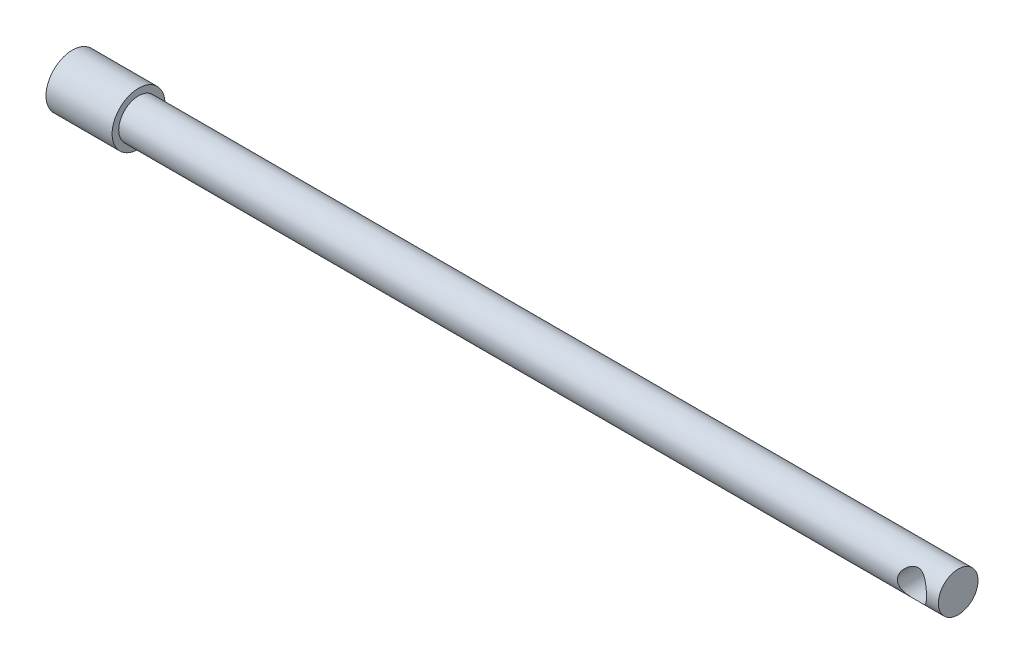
ISO-10303-21;
HEADER;
FILE_DESCRIPTION(('STEP AP214'),'2;1');
FILE_NAME('part.step','',(''),(''),'','','');
FILE_SCHEMA(('AUTOMOTIVE_DESIGN { 1 0 10303 214 1 1 1 1 }'));
ENDSEC;
DATA;
#1=APPLICATION_CONTEXT('core data for automotive mechanical design processes');
#2=APPLICATION_PROTOCOL_DEFINITION('international standard','automotive_design',2000,#1);
#3=PRODUCT_CONTEXT('',#1,'mechanical');
#4=PRODUCT('Part','Part','',(#3));
#5=PRODUCT_RELATED_PRODUCT_CATEGORY('part','',(#4));
#6=PRODUCT_DEFINITION_FORMATION('','',#4);
#7=PRODUCT_DEFINITION_CONTEXT('part definition',#1,'design');
#8=PRODUCT_DEFINITION('design','',#6,#7);
#9=PRODUCT_DEFINITION_SHAPE('','',#8);
#10=(LENGTH_UNIT() NAMED_UNIT(*) SI_UNIT(.MILLI.,.METRE.));
#11=(NAMED_UNIT(*) PLANE_ANGLE_UNIT() SI_UNIT($,.RADIAN.));
#12=(NAMED_UNIT(*) SI_UNIT($,.STERADIAN.) SOLID_ANGLE_UNIT());
#13=UNCERTAINTY_MEASURE_WITH_UNIT(LENGTH_MEASURE(1.E-05),#10,'distance_accuracy_value','');
#14=(GEOMETRIC_REPRESENTATION_CONTEXT(3) GLOBAL_UNCERTAINTY_ASSIGNED_CONTEXT((#13)) GLOBAL_UNIT_ASSIGNED_CONTEXT((#10,
#11,#12)) REPRESENTATION_CONTEXT('',''));
#15=CARTESIAN_POINT('',(0.,0.,0.));
#16=DIRECTION('',(0.,0.,1.));
#17=DIRECTION('',(1.,0.,0.));
#18=AXIS2_PLACEMENT_3D('',#15,#16,#17);
#19=CARTESIAN_POINT('',(-650.,0.,0.));
#20=DIRECTION('',(1.,0.,0.));
#21=DIRECTION('',(0.,0.,-1.));
#22=AXIS2_PLACEMENT_3D('',#19,#20,#21);
#23=PLANE('',#22);
#24=CARTESIAN_POINT('',(-650.,0.,0.));
#25=DIRECTION('',(-1.,0.,0.));
#26=DIRECTION('',(0.,0.,1.));
#27=AXIS2_PLACEMENT_3D('',#24,#25,#26);
#28=CIRCLE('',#27,20.);
#29=CARTESIAN_POINT('',(-650.,0.,20.));
#30=VERTEX_POINT('',#29);
#31=EDGE_CURVE('E18',#30,#30,#28,.F.);
#32=ORIENTED_EDGE('',*,*,#31,.F.);
#33=EDGE_LOOP('',(#32));
#34=FACE_BOUND('',#33,.T.);
#35=ADVANCED_FACE('F13',(#34),#23,.F.);
#36=CARTESIAN_POINT('',(-600.,0.,0.));
#37=DIRECTION('',(-1.,0.,0.));
#38=DIRECTION('',(0.,0.,1.));
#39=AXIS2_PLACEMENT_3D('',#36,#37,#38);
#40=CYLINDRICAL_SURFACE('',#39,20.);
#41=ORIENTED_EDGE('',*,*,#31,.T.);
#42=EDGE_LOOP('',(#41));
#43=FACE_BOUND('',#42,.T.);
#44=CARTESIAN_POINT('',(-600.,0.,0.));
#45=DIRECTION('',(-1.,0.,0.));
#46=DIRECTION('',(0.,0.,1.));
#47=AXIS2_PLACEMENT_3D('',#44,#45,#46);
#48=CIRCLE('',#47,20.);
#49=CARTESIAN_POINT('',(-600.,0.,20.));
#50=VERTEX_POINT('',#49);
#51=EDGE_CURVE('E46',#50,#50,#48,.T.);
#52=ORIENTED_EDGE('',*,*,#51,.T.);
#53=EDGE_LOOP('',(#52));
#54=FACE_BOUND('',#53,.T.);
#55=ADVANCED_FACE('F53',(#43,#54),#40,.T.);
#56=CARTESIAN_POINT('',(20.,0.,0.));
#57=DIRECTION('',(1.,0.,0.));
#58=DIRECTION('',(0.,0.,-1.));
#59=AXIS2_PLACEMENT_3D('',#56,#57,#58);
#60=PLANE('',#59);
#61=CARTESIAN_POINT('',(20.,0.,0.));
#62=DIRECTION('',(-1.,0.,0.));
#63=DIRECTION('',(0.,0.,1.));
#64=AXIS2_PLACEMENT_3D('',#61,#62,#63);
#65=CIRCLE('',#64,15.);
#66=CARTESIAN_POINT('',(20.,0.,15.));
#67=VERTEX_POINT('',#66);
#68=EDGE_CURVE('E44',#67,#67,#65,.T.);
#69=ORIENTED_EDGE('',*,*,#68,.F.);
#70=EDGE_LOOP('',(#69));
#71=FACE_BOUND('',#70,.T.);
#72=ADVANCED_FACE('F61',(#71),#60,.T.);
#73=CARTESIAN_POINT('',(-600.,0.,0.));
#74=DIRECTION('',(-1.,0.,0.));
#75=DIRECTION('',(0.,0.,1.));
#76=AXIS2_PLACEMENT_3D('',#73,#74,#75);
#77=PLANE('',#76);
#78=CARTESIAN_POINT('',(-600.,0.,0.));
#79=DIRECTION('',(-1.,0.,0.));
#80=DIRECTION('',(0.,0.,1.));
#81=AXIS2_PLACEMENT_3D('',#78,#79,#80);
#82=CIRCLE('',#81,15.);
#83=CARTESIAN_POINT('',(-600.,0.,15.));
#84=VERTEX_POINT('',#83);
#85=EDGE_CURVE('E22',#84,#84,#82,.F.);
#86=ORIENTED_EDGE('',*,*,#85,.F.);
#87=EDGE_LOOP('',(#86));
#88=FACE_BOUND('',#87,.T.);
#89=ORIENTED_EDGE('',*,*,#51,.F.);
#90=EDGE_LOOP('',(#89));
#91=FACE_BOUND('',#90,.T.);
#92=ADVANCED_FACE('F36',(#88,#91),#77,.F.);
#93=CARTESIAN_POINT('',(0.,0.,-15.));
#94=DIRECTION('',(0.,0.,1.));
#95=DIRECTION('',(1.,0.,0.));
#96=AXIS2_PLACEMENT_3D('',#93,#94,#95);
#97=CYLINDRICAL_SURFACE('',#96,11.);
#98=CARTESIAN_POINT('',(11.,0.,-15.));
#99=CARTESIAN_POINT('',(10.9999989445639,0.270234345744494,-14.9999989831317));
#100=CARTESIAN_POINT('',(10.9900265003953,0.540485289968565,-14.9926814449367));
#101=CARTESIAN_POINT('',(10.950295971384,1.07885095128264,-14.963582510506));
#102=CARTESIAN_POINT('',(10.9205289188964,1.34696464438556,-14.9417945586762));
#103=CARTESIAN_POINT('',(10.8416275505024,1.87926318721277,-14.8842251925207));
#104=CARTESIAN_POINT('',(10.792460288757,2.14344055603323,-14.8484199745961));
#105=CARTESIAN_POINT('',(10.6755308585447,2.66544248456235,-14.7636492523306));
#106=CARTESIAN_POINT('',(10.60777051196,2.92326766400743,-14.7146850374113));
#107=CARTESIAN_POINT('',(10.455056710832,3.42947281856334,-14.6049788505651));
#108=CARTESIAN_POINT('',(10.3702054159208,3.67789896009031,-14.5443069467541));
#109=CARTESIAN_POINT('',(10.1841148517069,4.16556445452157,-14.4122135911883));
#110=CARTESIAN_POINT('',(10.0828752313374,4.40480361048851,-14.3407919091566));
#111=CARTESIAN_POINT('',(9.86513916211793,4.87295052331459,-14.1885487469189));
#112=CARTESIAN_POINT('',(9.7486501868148,5.10186326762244,-14.1077318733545));
#113=CARTESIAN_POINT('',(9.50137535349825,5.5487947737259,-13.9380072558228));
#114=CARTESIAN_POINT('',(9.37058417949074,5.76680944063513,-13.8490965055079));
#115=CARTESIAN_POINT('',(9.08316785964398,6.21065135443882,-13.6561916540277));
#116=CARTESIAN_POINT('',(8.92527466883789,6.4353804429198,-13.5515613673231));
#117=CARTESIAN_POINT('',(8.59474679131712,6.8705899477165,-13.3361895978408));
#118=CARTESIAN_POINT('',(8.42211168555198,7.08106995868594,-13.2254479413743));
#119=CARTESIAN_POINT('',(8.06272673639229,7.48773584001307,-12.9995381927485));
#120=CARTESIAN_POINT('',(7.87595550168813,7.68389912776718,-12.8843635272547));
#121=CARTESIAN_POINT('',(7.48928883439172,8.06123556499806,-12.6517037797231));
#122=CARTESIAN_POINT('',(7.28939585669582,8.242411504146,-12.5342191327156));
#123=CARTESIAN_POINT('',(6.83682363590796,8.62331346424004,-12.2760403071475));
#124=CARTESIAN_POINT('',(6.58144005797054,8.81979231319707,-12.1352768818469));
#125=CARTESIAN_POINT('',(6.05311944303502,9.19042440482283,-11.8570571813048));
#126=CARTESIAN_POINT('',(5.7801773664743,9.36457119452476,-11.7196018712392));
#127=CARTESIAN_POINT('',(5.21744212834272,9.68936187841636,-11.4525286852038));
#128=CARTESIAN_POINT('',(4.92766801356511,9.84003165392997,-11.3229022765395));
#129=CARTESIAN_POINT('',(4.33141573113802,10.1166556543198,-11.076442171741));
#130=CARTESIAN_POINT('',(4.02494703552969,10.242623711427,-10.9596013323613));
#131=CARTESIAN_POINT('',(3.50094853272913,10.4303850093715,-10.7804394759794));
#132=CARTESIAN_POINT('',(3.28782250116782,10.4995737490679,-10.7129270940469));
#133=CARTESIAN_POINT('',(2.85500800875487,10.625426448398,-10.5881143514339));
#134=CARTESIAN_POINT('',(2.6353216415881,10.6820943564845,-10.5308107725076));
#135=CARTESIAN_POINT('',(2.19056026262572,10.7820819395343,-10.4284147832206));
#136=CARTESIAN_POINT('',(1.9654960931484,10.8254263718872,-10.3832997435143));
#137=CARTESIAN_POINT('',(1.51077883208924,10.8981901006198,-10.3069029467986));
#138=CARTESIAN_POINT('',(1.28112576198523,10.9276094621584,-10.2756211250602));
#139=CARTESIAN_POINT('',(0.817016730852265,10.9721120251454,-10.2280907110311));
#140=CARTESIAN_POINT('',(0.582537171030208,10.9870802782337,-10.2119626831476));
#141=CARTESIAN_POINT('',(0.112548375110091,11.0019364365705,-10.1959559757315));
#142=CARTESIAN_POINT('',(-0.122960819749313,11.0018249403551,-10.1960766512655));
#143=CARTESIAN_POINT('',(-0.593049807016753,10.9865203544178,-10.2125654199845));
#144=CARTESIAN_POINT('',(-0.827628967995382,10.9713183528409,-10.2289431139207));
#145=CARTESIAN_POINT('',(-1.29374843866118,10.9261645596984,-10.2771594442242));
#146=CARTESIAN_POINT('',(-1.52528840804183,10.8962111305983,-10.3089997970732));
#147=CARTESIAN_POINT('',(-2.00856310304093,10.8181280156,-10.3909399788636));
#148=CARTESIAN_POINT('',(-2.25976351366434,10.7683789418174,-10.4426460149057));
#149=CARTESIAN_POINT('',(-2.75472374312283,10.6525201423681,-10.5608080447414));
#150=CARTESIAN_POINT('',(-2.99848250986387,10.5864081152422,-10.6272661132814));
#151=CARTESIAN_POINT('',(-3.71799960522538,10.3647718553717,-10.8450088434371));
#152=CARTESIAN_POINT('',(-4.18133061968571,10.1860595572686,-11.0145361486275));
#153=CARTESIAN_POINT('',(-4.92554456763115,9.84116811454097,-11.3219366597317));
#154=CARTESIAN_POINT('',(-5.2168211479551,9.68975954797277,-11.4522158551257));
#155=CARTESIAN_POINT('',(-5.78225957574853,9.36333004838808,-11.7206082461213));
#156=CARTESIAN_POINT('',(-6.05641582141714,9.18830144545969,-11.8587239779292));
#157=CARTESIAN_POINT('',(-6.58728128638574,8.81550158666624,-12.1384232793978));
#158=CARTESIAN_POINT('',(-6.8439744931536,8.61770989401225,-12.2800098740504));
#159=CARTESIAN_POINT('',(-7.33908375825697,8.20016329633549,-12.562678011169));
#160=CARTESIAN_POINT('',(-7.57750193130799,7.9804109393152,-12.7037596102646));
#161=CARTESIAN_POINT('',(-8.03836541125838,7.51619216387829,-12.9838893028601));
#162=CARTESIAN_POINT('',(-8.26054003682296,7.27142254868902,-13.1228811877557));
#163=CARTESIAN_POINT('',(-8.68379183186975,6.76031353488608,-13.3933474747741));
#164=CARTESIAN_POINT('',(-8.88486659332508,6.4939716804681,-13.5248210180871));
#165=CARTESIAN_POINT('',(-9.26374282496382,5.9409781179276,-13.7766812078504));
#166=CARTESIAN_POINT('',(-9.44158119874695,5.65435975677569,-13.8970853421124));
#167=CARTESIAN_POINT('',(-9.7721047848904,5.06171559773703,-14.1237235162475));
#168=CARTESIAN_POINT('',(-9.92480016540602,4.75569771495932,-14.2299632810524));
#169=CARTESIAN_POINT('',(-10.1671126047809,4.20659794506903,-14.4001660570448));
#170=CARTESIAN_POINT('',(-10.2628788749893,3.96740850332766,-14.4679959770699));
#171=CARTESIAN_POINT('',(-10.4380921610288,3.48039642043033,-14.5928058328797));
#172=CARTESIAN_POINT('',(-10.5175428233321,3.2325757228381,-14.649788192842));
#173=CARTESIAN_POINT('',(-10.659004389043,2.73012906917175,-14.7516769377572));
#174=CARTESIAN_POINT('',(-10.7210502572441,2.47551789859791,-14.7966075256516));
#175=CARTESIAN_POINT('',(-10.8270300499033,1.96072320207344,-14.8735755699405));
#176=CARTESIAN_POINT('',(-10.87097136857,1.70054199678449,-14.9056182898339));
#177=CARTESIAN_POINT('',(-10.9368839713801,1.20084572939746,-14.953761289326));
#178=CARTESIAN_POINT('',(-10.9605217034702,0.961665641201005,-14.9710694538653));
#179=CARTESIAN_POINT('',(-10.9920819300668,0.481661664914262,-14.994190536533));
#180=CARTESIAN_POINT('',(-11.0000009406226,0.240837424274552,-15.0000009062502));
#181=CARTESIAN_POINT('',(-10.9999989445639,-0.270234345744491,-14.9999989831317));
#182=CARTESIAN_POINT('',(-10.9900265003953,-0.540485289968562,-14.9926814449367));
#183=CARTESIAN_POINT('',(-10.950295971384,-1.07885095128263,-14.963582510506));
#184=CARTESIAN_POINT('',(-10.9205289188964,-1.34696464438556,-14.9417945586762));
#185=CARTESIAN_POINT('',(-10.8416275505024,-1.87926318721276,-14.8842251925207));
#186=CARTESIAN_POINT('',(-10.792460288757,-2.14344055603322,-14.8484199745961));
#187=CARTESIAN_POINT('',(-10.6755308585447,-2.66544248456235,-14.7636492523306));
#188=CARTESIAN_POINT('',(-10.60777051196,-2.92326766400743,-14.7146850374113));
#189=CARTESIAN_POINT('',(-10.455056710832,-3.42947281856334,-14.6049788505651));
#190=CARTESIAN_POINT('',(-10.3702054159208,-3.67789896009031,-14.5443069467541));
#191=CARTESIAN_POINT('',(-10.1841148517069,-4.16556445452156,-14.4122135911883));
#192=CARTESIAN_POINT('',(-10.0828752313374,-4.40480361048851,-14.3407919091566));
#193=CARTESIAN_POINT('',(-9.86513916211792,-4.87295052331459,-14.1885487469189));
#194=CARTESIAN_POINT('',(-9.7486501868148,-5.10186326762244,-14.1077318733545));
#195=CARTESIAN_POINT('',(-9.50137535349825,-5.5487947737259,-13.9380072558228));
#196=CARTESIAN_POINT('',(-9.37058417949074,-5.76680944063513,-13.8490965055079));
#197=CARTESIAN_POINT('',(-9.08316785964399,-6.21065135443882,-13.6561916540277));
#198=CARTESIAN_POINT('',(-8.92527466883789,-6.4353804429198,-13.5515613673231));
#199=CARTESIAN_POINT('',(-8.59474679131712,-6.8705899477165,-13.3361895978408));
#200=CARTESIAN_POINT('',(-8.42211168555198,-7.08106995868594,-13.2254479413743));
#201=CARTESIAN_POINT('',(-8.06272673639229,-7.48773584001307,-12.9995381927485));
#202=CARTESIAN_POINT('',(-7.87595550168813,-7.68389912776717,-12.8843635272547));
#203=CARTESIAN_POINT('',(-7.48928883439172,-8.06123556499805,-12.6517037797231));
#204=CARTESIAN_POINT('',(-7.28939585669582,-8.242411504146,-12.5342191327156));
#205=CARTESIAN_POINT('',(-6.83682363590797,-8.62331346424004,-12.2760403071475));
#206=CARTESIAN_POINT('',(-6.58144005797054,-8.81979231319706,-12.1352768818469));
#207=CARTESIAN_POINT('',(-6.05311944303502,-9.19042440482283,-11.8570571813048));
#208=CARTESIAN_POINT('',(-5.78017736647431,-9.36457119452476,-11.7196018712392));
#209=CARTESIAN_POINT('',(-5.21744212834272,-9.68936187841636,-11.4525286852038));
#210=CARTESIAN_POINT('',(-4.92766801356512,-9.84003165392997,-11.3229022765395));
#211=CARTESIAN_POINT('',(-4.33141573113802,-10.1166556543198,-11.076442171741));
#212=CARTESIAN_POINT('',(-4.02494703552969,-10.242623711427,-10.9596013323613));
#213=CARTESIAN_POINT('',(-3.50094853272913,-10.4303850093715,-10.7804394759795));
#214=CARTESIAN_POINT('',(-3.28782250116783,-10.4995737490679,-10.7129270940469));
#215=CARTESIAN_POINT('',(-2.85500800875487,-10.625426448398,-10.5881143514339));
#216=CARTESIAN_POINT('',(-2.63532164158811,-10.6820943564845,-10.5308107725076));
#217=CARTESIAN_POINT('',(-2.19056026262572,-10.7820819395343,-10.4284147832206));
#218=CARTESIAN_POINT('',(-1.9654960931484,-10.8254263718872,-10.3832997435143));
#219=CARTESIAN_POINT('',(-1.51077883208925,-10.8981901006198,-10.3069029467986));
#220=CARTESIAN_POINT('',(-1.28112576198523,-10.9276094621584,-10.2756211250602));
#221=CARTESIAN_POINT('',(-0.817016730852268,-10.9721120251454,-10.2280907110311));
#222=CARTESIAN_POINT('',(-0.582537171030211,-10.9870802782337,-10.2119626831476));
#223=CARTESIAN_POINT('',(-0.112548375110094,-11.0019364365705,-10.1959559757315));
#224=CARTESIAN_POINT('',(0.12296081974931,-11.0018249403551,-10.1960766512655));
#225=CARTESIAN_POINT('',(0.593049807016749,-10.9865203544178,-10.2125654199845));
#226=CARTESIAN_POINT('',(0.827628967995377,-10.9713183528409,-10.2289431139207));
#227=CARTESIAN_POINT('',(1.29374843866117,-10.9261645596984,-10.2771594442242));
#228=CARTESIAN_POINT('',(1.52528840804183,-10.8962111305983,-10.3089997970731));
#229=CARTESIAN_POINT('',(2.00856310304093,-10.8181280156,-10.3909399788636));
#230=CARTESIAN_POINT('',(2.25976351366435,-10.7683789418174,-10.4426460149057));
#231=CARTESIAN_POINT('',(2.75472374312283,-10.652520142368,-10.5608080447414));
#232=CARTESIAN_POINT('',(2.99848250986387,-10.5864081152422,-10.6272661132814));
#233=CARTESIAN_POINT('',(3.71799960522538,-10.3647718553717,-10.8450088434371));
#234=CARTESIAN_POINT('',(4.1813306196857,-10.1860595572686,-11.0145361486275));
#235=CARTESIAN_POINT('',(4.92554456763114,-9.84116811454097,-11.3219366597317));
#236=CARTESIAN_POINT('',(5.21682114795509,-9.68975954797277,-11.4522158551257));
#237=CARTESIAN_POINT('',(5.78225957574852,-9.36333004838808,-11.7206082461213));
#238=CARTESIAN_POINT('',(6.05641582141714,-9.1883014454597,-11.8587239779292));
#239=CARTESIAN_POINT('',(6.58728128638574,-8.81550158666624,-12.1384232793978));
#240=CARTESIAN_POINT('',(6.84397449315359,-8.61770989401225,-12.2800098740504));
#241=CARTESIAN_POINT('',(7.33908375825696,-8.20016329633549,-12.562678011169));
#242=CARTESIAN_POINT('',(7.57750193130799,-7.9804109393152,-12.7037596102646));
#243=CARTESIAN_POINT('',(8.03836541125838,-7.51619216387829,-12.9838893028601));
#244=CARTESIAN_POINT('',(8.26054003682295,-7.27142254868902,-13.1228811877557));
#245=CARTESIAN_POINT('',(8.68379183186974,-6.76031353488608,-13.3933474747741));
#246=CARTESIAN_POINT('',(8.88486659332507,-6.49397168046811,-13.5248210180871));
#247=CARTESIAN_POINT('',(9.26374282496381,-5.94097811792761,-13.7766812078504));
#248=CARTESIAN_POINT('',(9.44158119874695,-5.6543597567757,-13.8970853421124));
#249=CARTESIAN_POINT('',(9.7721047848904,-5.06171559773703,-14.1237235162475));
#250=CARTESIAN_POINT('',(9.92480016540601,-4.75569771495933,-14.2299632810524));
#251=CARTESIAN_POINT('',(10.1671126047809,-4.20659794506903,-14.4001660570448));
#252=CARTESIAN_POINT('',(10.2628788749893,-3.96740850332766,-14.4679959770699));
#253=CARTESIAN_POINT('',(10.4380921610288,-3.48039642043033,-14.5928058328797));
#254=CARTESIAN_POINT('',(10.5175428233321,-3.2325757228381,-14.649788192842));
#255=CARTESIAN_POINT('',(10.659004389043,-2.73012906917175,-14.7516769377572));
#256=CARTESIAN_POINT('',(10.7210502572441,-2.47551789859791,-14.7966075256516));
#257=CARTESIAN_POINT('',(10.8270300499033,-1.96072320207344,-14.8735755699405));
#258=CARTESIAN_POINT('',(10.87097136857,-1.7005419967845,-14.9056182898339));
#259=CARTESIAN_POINT('',(10.9368839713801,-1.20084572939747,-14.953761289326));
#260=CARTESIAN_POINT('',(10.9605217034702,-0.961665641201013,-14.9710694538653));
#261=CARTESIAN_POINT('',(10.9920819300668,-0.481661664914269,-14.994190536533));
#262=CARTESIAN_POINT('',(11.0000009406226,-0.240837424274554,-15.0000009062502));
#263=CARTESIAN_POINT('',(11.,0.,-15.));
#264=B_SPLINE_CURVE_WITH_KNOTS('',3,(#98,#99,#100,#101,#102,#103,#104,#105,#106,#107,#108,#109,
#110,#111,#112,#113,#114,#115,#116,#117,#118,#119,#120,#121,#122,#123,#124,#125,#126,#127,#128,
#129,#130,#131,#132,#133,#134,#135,#136,#137,#138,#139,#140,#141,#142,#143,#144,#145,#146,#147,
#148,#149,#150,#151,#152,#153,#154,#155,#156,#157,#158,#159,#160,#161,#162,#163,#164,#165,#166,
#167,#168,#169,#170,#171,#172,#173,#174,#175,#176,#177,#178,#179,#180,#181,#182,#183,#184,#185,
#186,#187,#188,#189,#190,#191,#192,#193,#194,#195,#196,#197,#198,#199,#200,#201,#202,#203,#204,
#205,#206,#207,#208,#209,#210,#211,#212,#213,#214,#215,#216,#217,#218,#219,#220,#221,#222,#223,
#224,#225,#226,#227,#228,#229,#230,#231,#232,#233,#234,#235,#236,#237,#238,#239,#240,#241,#242,
#243,#244,#245,#246,#247,#248,#249,#250,#251,#252,#253,#254,#255,#256,#257,#258,#259,#260,#261,
#262,#263),.UNSPECIFIED.,.T.,.F.,(4,2,2,2,2,2,2,2,2,2,2,2,2,2,2,2,2,2,2,2,2,2,2,2,2,2,2,2,2,2,2,
2,2,2,2,2,2,2,2,2,2,2,2,2,2,2,2,2,2,2,2,2,2,2,2,2,2,2,2,2,2,2,2,2,2,2,2,2,2,2,2,2,2,2,2,2,2,2,2,
2,2,2,4),(0.,0.810451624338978,1.62127066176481,2.43347261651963,3.245595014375,
4.05299986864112,4.86042202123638,5.66744993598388,6.4747788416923,7.35566894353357,
8.23658409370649,9.11886000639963,10.0009713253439,11.0546742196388,12.1086809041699,
13.1615172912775,14.2137624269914,14.9152774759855,15.6165709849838,16.3165533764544,
17.0165324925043,17.7220346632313,18.4275088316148,19.1333998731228,19.8393692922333,
20.6219293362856,21.4045995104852,22.9719812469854,24.0304577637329,25.0892788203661,
26.1490580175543,27.2087143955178,28.2832214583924,29.3578510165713,30.4307525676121,
31.5032191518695,32.301720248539,33.100042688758,33.8967496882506,34.6931309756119,
35.4152591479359,36.1375473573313,36.9479989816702,37.7588180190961,38.5710199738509,
39.3831423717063,40.1905472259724,40.9979693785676,41.8049972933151,42.6123261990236,
43.4932163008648,44.3741314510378,45.2564073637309,46.1385186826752,47.1922215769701,
48.2462282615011,49.2990646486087,50.3513097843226,51.0528248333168,51.7541183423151,
52.4541007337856,53.1540798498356,53.8595820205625,54.5650561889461,55.2709472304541,
55.9769166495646,56.7594766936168,57.5421468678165,59.1095286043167,60.1680051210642,
61.2268261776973,62.2866053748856,63.3462617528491,64.4207688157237,65.4953983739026,
66.5682999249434,67.6407665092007,68.4392676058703,69.2375900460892,70.0342970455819,
70.8306783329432,71.5528065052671,72.2750947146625),.UNSPECIFIED.);
#265=CARTESIAN_POINT('',(11.,0.,-15.));
#266=VERTEX_POINT('',#265);
#267=EDGE_CURVE('E27',#266,#266,#264,.T.);
#268=ORIENTED_EDGE('',*,*,#267,.F.);
#269=EDGE_LOOP('',(#268));
#270=FACE_BOUND('',#269,.T.);
#271=CARTESIAN_POINT('',(-11.,0.,15.));
#272=CARTESIAN_POINT('',(-10.9999989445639,0.270234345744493,14.9999989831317));
#273=CARTESIAN_POINT('',(-10.9900265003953,0.540485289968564,14.9926814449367));
#274=CARTESIAN_POINT('',(-10.950295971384,1.07885095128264,14.963582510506));
#275=CARTESIAN_POINT('',(-10.9205289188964,1.34696464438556,14.9417945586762));
#276=CARTESIAN_POINT('',(-10.8416275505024,1.87926318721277,14.8842251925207));
#277=CARTESIAN_POINT('',(-10.792460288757,2.14344055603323,14.8484199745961));
#278=CARTESIAN_POINT('',(-10.6755308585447,2.66544248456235,14.7636492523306));
#279=CARTESIAN_POINT('',(-10.60777051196,2.92326766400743,14.7146850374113));
#280=CARTESIAN_POINT('',(-10.455056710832,3.42947281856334,14.6049788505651));
#281=CARTESIAN_POINT('',(-10.3702054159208,3.67789896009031,14.5443069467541));
#282=CARTESIAN_POINT('',(-10.1841148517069,4.16556445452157,14.4122135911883));
#283=CARTESIAN_POINT('',(-10.0828752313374,4.40480361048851,14.3407919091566));
#284=CARTESIAN_POINT('',(-9.86513916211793,4.87295052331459,14.1885487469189));
#285=CARTESIAN_POINT('',(-9.7486501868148,5.10186326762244,14.1077318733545));
#286=CARTESIAN_POINT('',(-9.50137535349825,5.5487947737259,13.9380072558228));
#287=CARTESIAN_POINT('',(-9.37058417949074,5.76680944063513,13.8490965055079));
#288=CARTESIAN_POINT('',(-9.08316785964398,6.21065135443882,13.6561916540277));
#289=CARTESIAN_POINT('',(-8.92527466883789,6.4353804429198,13.5515613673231));
#290=CARTESIAN_POINT('',(-8.59474679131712,6.8705899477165,13.3361895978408));
#291=CARTESIAN_POINT('',(-8.42211168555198,7.08106995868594,13.2254479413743));
#292=CARTESIAN_POINT('',(-8.06272673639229,7.48773584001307,12.9995381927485));
#293=CARTESIAN_POINT('',(-7.87595550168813,7.68389912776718,12.8843635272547));
#294=CARTESIAN_POINT('',(-7.48928883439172,8.06123556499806,12.6517037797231));
#295=CARTESIAN_POINT('',(-7.28939585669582,8.242411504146,12.5342191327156));
#296=CARTESIAN_POINT('',(-6.83682363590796,8.62331346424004,12.2760403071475));
#297=CARTESIAN_POINT('',(-6.58144005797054,8.81979231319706,12.1352768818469));
#298=CARTESIAN_POINT('',(-6.05311944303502,9.19042440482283,11.8570571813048));
#299=CARTESIAN_POINT('',(-5.7801773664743,9.36457119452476,11.7196018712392));
#300=CARTESIAN_POINT('',(-5.21744212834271,9.68936187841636,11.4525286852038));
#301=CARTESIAN_POINT('',(-4.92766801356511,9.84003165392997,11.3229022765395));
#302=CARTESIAN_POINT('',(-4.33141573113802,10.1166556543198,11.076442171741));
#303=CARTESIAN_POINT('',(-4.02494703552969,10.242623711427,10.9596013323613));
#304=CARTESIAN_POINT('',(-3.50094853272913,10.4303850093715,10.7804394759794));
#305=CARTESIAN_POINT('',(-3.28782250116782,10.4995737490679,10.7129270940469));
#306=CARTESIAN_POINT('',(-2.85500800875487,10.625426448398,10.5881143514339));
#307=CARTESIAN_POINT('',(-2.6353216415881,10.6820943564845,10.5308107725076));
#308=CARTESIAN_POINT('',(-2.19056026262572,10.7820819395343,10.4284147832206));
#309=CARTESIAN_POINT('',(-1.9654960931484,10.8254263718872,10.3832997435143));
#310=CARTESIAN_POINT('',(-1.51077883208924,10.8981901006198,10.3069029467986));
#311=CARTESIAN_POINT('',(-1.28112576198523,10.9276094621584,10.2756211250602));
#312=CARTESIAN_POINT('',(-0.817016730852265,10.9721120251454,10.2280907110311));
#313=CARTESIAN_POINT('',(-0.582537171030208,10.9870802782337,10.2119626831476));
#314=CARTESIAN_POINT('',(-0.112548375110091,11.0019364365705,10.1959559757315));
#315=CARTESIAN_POINT('',(0.122960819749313,11.0018249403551,10.1960766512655));
#316=CARTESIAN_POINT('',(0.593049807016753,10.9865203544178,10.2125654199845));
#317=CARTESIAN_POINT('',(0.827628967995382,10.9713183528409,10.2289431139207));
#318=CARTESIAN_POINT('',(1.29374843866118,10.9261645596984,10.2771594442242));
#319=CARTESIAN_POINT('',(1.52528840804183,10.8962111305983,10.3089997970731));
#320=CARTESIAN_POINT('',(2.00856310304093,10.8181280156,10.3909399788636));
#321=CARTESIAN_POINT('',(2.25976351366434,10.7683789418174,10.4426460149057));
#322=CARTESIAN_POINT('',(2.75472374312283,10.652520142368,10.5608080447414));
#323=CARTESIAN_POINT('',(2.99848250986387,10.5864081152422,10.6272661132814));
#324=CARTESIAN_POINT('',(3.71799960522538,10.3647718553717,10.8450088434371));
#325=CARTESIAN_POINT('',(4.18133061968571,10.1860595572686,11.0145361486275));
#326=CARTESIAN_POINT('',(4.92554456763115,9.84116811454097,11.3219366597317));
#327=CARTESIAN_POINT('',(5.2168211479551,9.68975954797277,11.4522158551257));
#328=CARTESIAN_POINT('',(5.78225957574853,9.36333004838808,11.7206082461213));
#329=CARTESIAN_POINT('',(6.05641582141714,9.18830144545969,11.8587239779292));
#330=CARTESIAN_POINT('',(6.58728128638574,8.81550158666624,12.1384232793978));
#331=CARTESIAN_POINT('',(6.8439744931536,8.61770989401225,12.2800098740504));
#332=CARTESIAN_POINT('',(7.33908375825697,8.20016329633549,12.562678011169));
#333=CARTESIAN_POINT('',(7.57750193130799,7.9804109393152,12.7037596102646));
#334=CARTESIAN_POINT('',(8.03836541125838,7.51619216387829,12.9838893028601));
#335=CARTESIAN_POINT('',(8.26054003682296,7.27142254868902,13.1228811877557));
#336=CARTESIAN_POINT('',(8.68379183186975,6.76031353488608,13.3933474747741));
#337=CARTESIAN_POINT('',(8.88486659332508,6.4939716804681,13.5248210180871));
#338=CARTESIAN_POINT('',(9.26374282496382,5.9409781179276,13.7766812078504));
#339=CARTESIAN_POINT('',(9.44158119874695,5.65435975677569,13.8970853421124));
#340=CARTESIAN_POINT('',(9.7721047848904,5.06171559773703,14.1237235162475));
#341=CARTESIAN_POINT('',(9.92480016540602,4.75569771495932,14.2299632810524));
#342=CARTESIAN_POINT('',(10.1671126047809,4.20659794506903,14.4001660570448));
#343=CARTESIAN_POINT('',(10.2628788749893,3.96740850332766,14.4679959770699));
#344=CARTESIAN_POINT('',(10.4380921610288,3.48039642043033,14.5928058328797));
#345=CARTESIAN_POINT('',(10.5175428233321,3.2325757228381,14.649788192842));
#346=CARTESIAN_POINT('',(10.659004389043,2.73012906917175,14.7516769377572));
#347=CARTESIAN_POINT('',(10.7210502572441,2.47551789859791,14.7966075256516));
#348=CARTESIAN_POINT('',(10.8270300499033,1.96072320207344,14.8735755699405));
#349=CARTESIAN_POINT('',(10.87097136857,1.70054199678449,14.9056182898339));
#350=CARTESIAN_POINT('',(10.9368839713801,1.20084572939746,14.953761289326));
#351=CARTESIAN_POINT('',(10.9605217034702,0.961665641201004,14.9710694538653));
#352=CARTESIAN_POINT('',(10.9920819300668,0.48166166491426,14.994190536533));
#353=CARTESIAN_POINT('',(11.0000009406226,0.24083742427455,15.0000009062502));
#354=CARTESIAN_POINT('',(10.9999989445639,-0.270234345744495,14.9999989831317));
#355=CARTESIAN_POINT('',(10.9900265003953,-0.540485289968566,14.9926814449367));
#356=CARTESIAN_POINT('',(10.950295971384,-1.07885095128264,14.963582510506));
#357=CARTESIAN_POINT('',(10.9205289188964,-1.34696464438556,14.9417945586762));
#358=CARTESIAN_POINT('',(10.8416275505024,-1.87926318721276,14.8842251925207));
#359=CARTESIAN_POINT('',(10.792460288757,-2.14344055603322,14.8484199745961));
#360=CARTESIAN_POINT('',(10.6755308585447,-2.66544248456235,14.7636492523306));
#361=CARTESIAN_POINT('',(10.60777051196,-2.92326766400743,14.7146850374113));
#362=CARTESIAN_POINT('',(10.455056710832,-3.42947281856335,14.6049788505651));
#363=CARTESIAN_POINT('',(10.3702054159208,-3.67789896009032,14.5443069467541));
#364=CARTESIAN_POINT('',(10.1841148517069,-4.16556445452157,14.4122135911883));
#365=CARTESIAN_POINT('',(10.0828752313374,-4.40480361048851,14.3407919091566));
#366=CARTESIAN_POINT('',(9.86513916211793,-4.87295052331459,14.1885487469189));
#367=CARTESIAN_POINT('',(9.7486501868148,-5.10186326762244,14.1077318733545));
#368=CARTESIAN_POINT('',(9.50137535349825,-5.54879477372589,13.9380072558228));
#369=CARTESIAN_POINT('',(9.37058417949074,-5.76680944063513,13.8490965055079));
#370=CARTESIAN_POINT('',(9.08316785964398,-6.21065135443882,13.6561916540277));
#371=CARTESIAN_POINT('',(8.92527466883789,-6.4353804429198,13.5515613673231));
#372=CARTESIAN_POINT('',(8.59474679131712,-6.8705899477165,13.3361895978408));
#373=CARTESIAN_POINT('',(8.42211168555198,-7.08106995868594,13.2254479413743));
#374=CARTESIAN_POINT('',(8.06272673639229,-7.48773584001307,12.9995381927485));
#375=CARTESIAN_POINT('',(7.87595550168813,-7.68389912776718,12.8843635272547));
#376=CARTESIAN_POINT('',(7.48928883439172,-8.06123556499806,12.6517037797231));
#377=CARTESIAN_POINT('',(7.28939585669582,-8.242411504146,12.5342191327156));
#378=CARTESIAN_POINT('',(6.83682363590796,-8.62331346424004,12.2760403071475));
#379=CARTESIAN_POINT('',(6.58144005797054,-8.81979231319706,12.1352768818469));
#380=CARTESIAN_POINT('',(6.05311944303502,-9.19042440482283,11.8570571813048));
#381=CARTESIAN_POINT('',(5.78017736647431,-9.36457119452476,11.7196018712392));
#382=CARTESIAN_POINT('',(5.21744212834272,-9.68936187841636,11.4525286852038));
#383=CARTESIAN_POINT('',(4.92766801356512,-9.84003165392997,11.3229022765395));
#384=CARTESIAN_POINT('',(4.33141573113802,-10.1166556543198,11.076442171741));
#385=CARTESIAN_POINT('',(4.02494703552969,-10.242623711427,10.9596013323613));
#386=CARTESIAN_POINT('',(3.50094853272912,-10.4303850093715,10.7804394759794));
#387=CARTESIAN_POINT('',(3.28782250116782,-10.4995737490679,10.7129270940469));
#388=CARTESIAN_POINT('',(2.85500800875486,-10.625426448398,10.5881143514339));
#389=CARTESIAN_POINT('',(2.6353216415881,-10.6820943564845,10.5308107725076));
#390=CARTESIAN_POINT('',(2.19056026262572,-10.7820819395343,10.4284147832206));
#391=CARTESIAN_POINT('',(1.9654960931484,-10.8254263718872,10.3832997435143));
#392=CARTESIAN_POINT('',(1.51077883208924,-10.8981901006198,10.3069029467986));
#393=CARTESIAN_POINT('',(1.28112576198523,-10.9276094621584,10.2756211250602));
#394=CARTESIAN_POINT('',(0.817016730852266,-10.9721120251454,10.2280907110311));
#395=CARTESIAN_POINT('',(0.58253717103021,-10.9870802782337,10.2119626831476));
#396=CARTESIAN_POINT('',(0.112548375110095,-11.0019364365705,10.1959559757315));
#397=CARTESIAN_POINT('',(-0.122960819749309,-11.0018249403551,10.1960766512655));
#398=CARTESIAN_POINT('',(-0.59304980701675,-10.9865203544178,10.2125654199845));
#399=CARTESIAN_POINT('',(-0.82762896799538,-10.9713183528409,10.2289431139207));
#400=CARTESIAN_POINT('',(-1.29374843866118,-10.9261645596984,10.2771594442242));
#401=CARTESIAN_POINT('',(-1.52528840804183,-10.8962111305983,10.3089997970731));
#402=CARTESIAN_POINT('',(-2.00856310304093,-10.8181280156,10.3909399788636));
#403=CARTESIAN_POINT('',(-2.25976351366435,-10.7683789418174,10.4426460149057));
#404=CARTESIAN_POINT('',(-2.75472374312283,-10.652520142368,10.5608080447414));
#405=CARTESIAN_POINT('',(-2.99848250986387,-10.5864081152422,10.6272661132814));
#406=CARTESIAN_POINT('',(-3.71799960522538,-10.3647718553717,10.8450088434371));
#407=CARTESIAN_POINT('',(-4.1813306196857,-10.1860595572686,11.0145361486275));
#408=CARTESIAN_POINT('',(-4.92554456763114,-9.84116811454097,11.3219366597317));
#409=CARTESIAN_POINT('',(-5.2168211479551,-9.68975954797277,11.4522158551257));
#410=CARTESIAN_POINT('',(-5.78225957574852,-9.36333004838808,11.7206082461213));
#411=CARTESIAN_POINT('',(-6.05641582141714,-9.1883014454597,11.8587239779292));
#412=CARTESIAN_POINT('',(-6.58728128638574,-8.81550158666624,12.1384232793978));
#413=CARTESIAN_POINT('',(-6.8439744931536,-8.61770989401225,12.2800098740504));
#414=CARTESIAN_POINT('',(-7.33908375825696,-8.20016329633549,12.562678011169));
#415=CARTESIAN_POINT('',(-7.57750193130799,-7.9804109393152,12.7037596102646));
#416=CARTESIAN_POINT('',(-8.03836541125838,-7.51619216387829,12.9838893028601));
#417=CARTESIAN_POINT('',(-8.26054003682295,-7.27142254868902,13.1228811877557));
#418=CARTESIAN_POINT('',(-8.68379183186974,-6.76031353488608,13.3933474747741));
#419=CARTESIAN_POINT('',(-8.88486659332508,-6.4939716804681,13.524821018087));
#420=CARTESIAN_POINT('',(-9.26374282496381,-5.9409781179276,13.7766812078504));
#421=CARTESIAN_POINT('',(-9.44158119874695,-5.6543597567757,13.8970853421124));
#422=CARTESIAN_POINT('',(-9.7721047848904,-5.06171559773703,14.1237235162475));
#423=CARTESIAN_POINT('',(-9.92480016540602,-4.75569771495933,14.2299632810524));
#424=CARTESIAN_POINT('',(-10.1671126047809,-4.20659794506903,14.4001660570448));
#425=CARTESIAN_POINT('',(-10.2628788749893,-3.96740850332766,14.4679959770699));
#426=CARTESIAN_POINT('',(-10.4380921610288,-3.48039642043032,14.5928058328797));
#427=CARTESIAN_POINT('',(-10.5175428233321,-3.2325757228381,14.649788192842));
#428=CARTESIAN_POINT('',(-10.659004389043,-2.73012906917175,14.7516769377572));
#429=CARTESIAN_POINT('',(-10.7210502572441,-2.47551789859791,14.7966075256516));
#430=CARTESIAN_POINT('',(-10.8270300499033,-1.96072320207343,14.8735755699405));
#431=CARTESIAN_POINT('',(-10.87097136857,-1.70054199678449,14.9056182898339));
#432=CARTESIAN_POINT('',(-10.9368839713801,-1.20084572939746,14.953761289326));
#433=CARTESIAN_POINT('',(-10.9605217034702,-0.961665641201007,14.9710694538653));
#434=CARTESIAN_POINT('',(-10.9920819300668,-0.481661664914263,14.994190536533));
#435=CARTESIAN_POINT('',(-11.0000009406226,-0.240837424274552,15.0000009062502));
#436=CARTESIAN_POINT('',(-11.,0.,15.));
#437=B_SPLINE_CURVE_WITH_KNOTS('',3,(#271,#272,#273,#274,#275,#276,#277,#278,#279,#280,#281,
#282,#283,#284,#285,#286,#287,#288,#289,#290,#291,#292,#293,#294,#295,#296,#297,#298,#299,#300,
#301,#302,#303,#304,#305,#306,#307,#308,#309,#310,#311,#312,#313,#314,#315,#316,#317,#318,#319,
#320,#321,#322,#323,#324,#325,#326,#327,#328,#329,#330,#331,#332,#333,#334,#335,#336,#337,#338,
#339,#340,#341,#342,#343,#344,#345,#346,#347,#348,#349,#350,#351,#352,#353,#354,#355,#356,#357,
#358,#359,#360,#361,#362,#363,#364,#365,#366,#367,#368,#369,#370,#371,#372,#373,#374,#375,#376,
#377,#378,#379,#380,#381,#382,#383,#384,#385,#386,#387,#388,#389,#390,#391,#392,#393,#394,#395,
#396,#397,#398,#399,#400,#401,#402,#403,#404,#405,#406,#407,#408,#409,#410,#411,#412,#413,#414,
#415,#416,#417,#418,#419,#420,#421,#422,#423,#424,#425,#426,#427,#428,#429,#430,#431,#432,#433,
#434,#435,#436),.UNSPECIFIED.,.T.,.F.,(4,2,2,2,2,2,2,2,2,2,2,2,2,2,2,2,2,2,2,2,2,2,2,2,2,2,2,2,
2,2,2,2,2,2,2,2,2,2,2,2,2,2,2,2,2,2,2,2,2,2,2,2,2,2,2,2,2,2,2,2,2,2,2,2,2,2,2,2,2,2,2,2,2,2,2,2,
2,2,2,2,2,2,4),(0.,0.810451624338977,1.62127066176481,2.43347261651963,3.245595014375,
4.05299986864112,4.86042202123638,5.66744993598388,6.4747788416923,7.35566894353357,
8.23658409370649,9.11886000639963,10.0009713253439,11.0546742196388,12.1086809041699,
13.1615172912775,14.2137624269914,14.9152774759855,15.6165709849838,16.3165533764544,
17.0165324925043,17.7220346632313,18.4275088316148,19.1333998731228,19.8393692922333,
20.6219293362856,21.4045995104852,22.9719812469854,24.0304577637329,25.0892788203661,
26.1490580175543,27.2087143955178,28.2832214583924,29.3578510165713,30.4307525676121,
31.5032191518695,32.301720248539,33.100042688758,33.8967496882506,34.6931309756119,
35.4152591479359,36.1375473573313,36.9479989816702,37.7588180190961,38.5710199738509,
39.3831423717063,40.1905472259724,40.9979693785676,41.8049972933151,42.6123261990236,
43.4932163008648,44.3741314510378,45.2564073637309,46.1385186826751,47.1922215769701,
48.2462282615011,49.2990646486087,50.3513097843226,51.0528248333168,51.7541183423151,
52.4541007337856,53.1540798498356,53.8595820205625,54.5650561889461,55.2709472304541,
55.9769166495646,56.7594766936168,57.5421468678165,59.1095286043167,60.1680051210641,
61.2268261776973,62.2866053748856,63.346261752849,64.4207688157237,65.4953983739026,
66.5682999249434,67.6407665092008,68.4392676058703,69.2375900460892,70.0342970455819,
70.8306783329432,71.5528065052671,72.2750947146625),.UNSPECIFIED.);
#438=CARTESIAN_POINT('',(-11.,0.,15.));
#439=VERTEX_POINT('',#438);
#440=EDGE_CURVE('E9',#439,#439,#437,.T.);
#441=ORIENTED_EDGE('',*,*,#440,.F.);
#442=EDGE_LOOP('',(#441));
#443=FACE_BOUND('',#442,.T.);
#444=ADVANCED_FACE('F32',(#270,#443),#97,.F.);
#445=CARTESIAN_POINT('',(20.,0.,0.));
#446=DIRECTION('',(-1.,0.,0.));
#447=DIRECTION('',(0.,0.,1.));
#448=AXIS2_PLACEMENT_3D('',#445,#446,#447);
#449=CYLINDRICAL_SURFACE('',#448,15.);
#450=ORIENTED_EDGE('',*,*,#267,.T.);
#451=EDGE_LOOP('',(#450));
#452=FACE_BOUND('',#451,.T.);
#453=ORIENTED_EDGE('',*,*,#85,.T.);
#454=EDGE_LOOP('',(#453));
#455=FACE_BOUND('',#454,.T.);
#456=ORIENTED_EDGE('',*,*,#440,.T.);
#457=EDGE_LOOP('',(#456));
#458=FACE_BOUND('',#457,.T.);
#459=ORIENTED_EDGE('',*,*,#68,.T.);
#460=EDGE_LOOP('',(#459));
#461=FACE_BOUND('',#460,.T.);
#462=ADVANCED_FACE('F15',(#452,#455,#458,#461),#449,.T.);
#463=CLOSED_SHELL('',(#35,#55,#72,#92,#444,#462));
#464=MANIFOLD_SOLID_BREP('B1',#463);
#465=ADVANCED_BREP_SHAPE_REPRESENTATION('',(#18,#464),#14);
#466=SHAPE_DEFINITION_REPRESENTATION(#9,#465);
ENDSEC;
END-ISO-10303-21;
